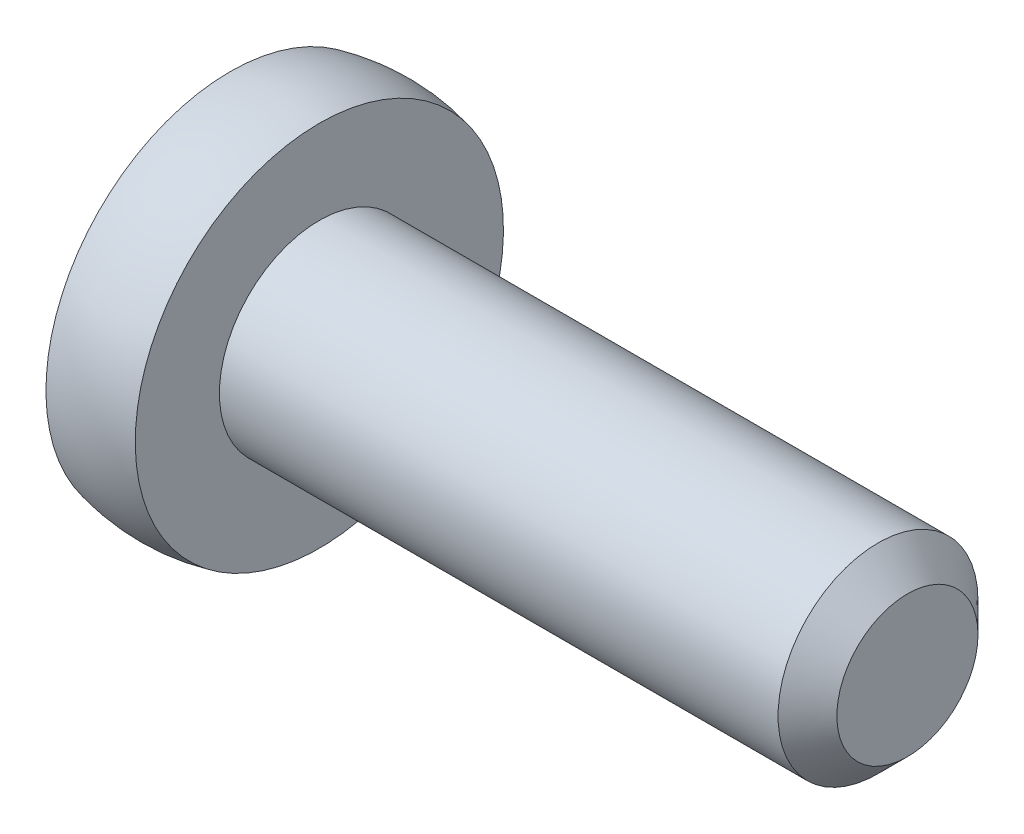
ISO-10303-21;
HEADER;
FILE_DESCRIPTION(('STEP AP214'),'2;1');
FILE_NAME('part.step','',(''),(''),'','','');
FILE_SCHEMA(('AUTOMOTIVE_DESIGN { 1 0 10303 214 1 1 1 1 }'));
ENDSEC;
DATA;
#1=APPLICATION_CONTEXT('core data for automotive mechanical design processes');
#2=APPLICATION_PROTOCOL_DEFINITION('international standard','automotive_design',2000,#1);
#3=PRODUCT_CONTEXT('',#1,'mechanical');
#4=PRODUCT('Part','Part','',(#3));
#5=PRODUCT_RELATED_PRODUCT_CATEGORY('part','',(#4));
#6=PRODUCT_DEFINITION_FORMATION('','',#4);
#7=PRODUCT_DEFINITION_CONTEXT('part definition',#1,'design');
#8=PRODUCT_DEFINITION('design','',#6,#7);
#9=PRODUCT_DEFINITION_SHAPE('','',#8);
#10=(LENGTH_UNIT() NAMED_UNIT(*) SI_UNIT(.MILLI.,.METRE.));
#11=(NAMED_UNIT(*) PLANE_ANGLE_UNIT() SI_UNIT($,.RADIAN.));
#12=(NAMED_UNIT(*) SI_UNIT($,.STERADIAN.) SOLID_ANGLE_UNIT());
#13=UNCERTAINTY_MEASURE_WITH_UNIT(LENGTH_MEASURE(1.E-05),#10,'distance_accuracy_value','');
#14=(GEOMETRIC_REPRESENTATION_CONTEXT(3) GLOBAL_UNCERTAINTY_ASSIGNED_CONTEXT((#13)) GLOBAL_UNIT_ASSIGNED_CONTEXT((#10,
#11,#12)) REPRESENTATION_CONTEXT('',''));
#15=CARTESIAN_POINT('',(0.,0.,0.));
#16=DIRECTION('',(0.,0.,1.));
#17=DIRECTION('',(1.,0.,0.));
#18=AXIS2_PLACEMENT_3D('',#15,#16,#17);
#19=CARTESIAN_POINT('',(2.20574710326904,0.,0.));
#20=DIRECTION('',(1.,0.,0.));
#21=DIRECTION('',(0.,0.,-1.));
#22=AXIS2_PLACEMENT_3D('',#19,#20,#21);
#23=PLANE('',#22);
#24=CARTESIAN_POINT('',(2.20574710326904,0.,0.));
#25=DIRECTION('',(1.,0.,0.));
#26=DIRECTION('',(0.,0.,-1.));
#27=AXIS2_PLACEMENT_3D('',#24,#25,#26);
#28=CIRCLE('',#27,3.97587531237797);
#29=CARTESIAN_POINT('',(2.20574710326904,3.97587531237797,0.));
#30=VERTEX_POINT('',#29);
#31=EDGE_CURVE('E147',#30,#30,#28,.T.);
#32=ORIENTED_EDGE('',*,*,#31,.T.);
#33=EDGE_LOOP('',(#32));
#34=FACE_BOUND('',#33,.T.);
#35=CARTESIAN_POINT('',(2.20574710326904,0.,0.));
#36=DIRECTION('',(1.,0.,0.));
#37=DIRECTION('',(0.,0.,-1.));
#38=AXIS2_PLACEMENT_3D('',#35,#36,#37);
#39=CIRCLE('',#38,2.159);
#40=CARTESIAN_POINT('',(2.20574710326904,0.,-2.159));
#41=VERTEX_POINT('',#40);
#42=EDGE_CURVE('E140',#41,#41,#39,.T.);
#43=ORIENTED_EDGE('',*,*,#42,.F.);
#44=EDGE_LOOP('',(#43));
#45=FACE_BOUND('',#44,.T.);
#46=ADVANCED_FACE('F36',(#34,#45),#23,.T.);
#47=CARTESIAN_POINT('',(6.77774710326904,0.,0.));
#48=DIRECTION('',(1.,0.,0.));
#49=DIRECTION('',(0.,1.,0.));
#50=AXIS2_PLACEMENT_3D('',#47,#48,#49);
#51=SPHERICAL_SURFACE('',#50,7.62);
#52=CARTESIAN_POINT('',(0.277222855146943,0.,0.));
#53=DIRECTION('',(1.,0.,0.));
#54=DIRECTION('',(0.,0.,-1.));
#55=AXIS2_PLACEMENT_3D('',#52,#53,#54);
#56=CIRCLE('',#55,3.97587531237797);
#57=CARTESIAN_POINT('',(0.277222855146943,3.97587531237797,0.));
#58=VERTEX_POINT('',#57);
#59=EDGE_CURVE('E143',#58,#58,#56,.T.);
#60=ORIENTED_EDGE('',*,*,#59,.F.);
#61=EDGE_LOOP('',(#60));
#62=FACE_BOUND('',#61,.T.);
#63=CARTESIAN_POINT('',(6.58914186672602,-0.97028982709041,0.));
#64=DIRECTION('',(0.190808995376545,0.981627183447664,0.));
#65=DIRECTION('',(-0.981627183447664,0.190808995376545,0.));
#66=AXIS2_PLACEMENT_3D('',#63,#64,#65);
#67=CIRCLE('',#66,7.55561815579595);
#68=CARTESIAN_POINT('',(-0.813379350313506,0.468614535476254,0.468614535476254));
#69=VERTEX_POINT('',#68);
#70=CARTESIAN_POINT('',(-0.434610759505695,0.394989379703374,2.42698937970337));
#71=VERTEX_POINT('',#70);
#72=EDGE_CURVE('E201',#69,#71,#67,.T.);
#73=ORIENTED_EDGE('',*,*,#72,.T.);
#74=CARTESIAN_POINT('',(6.96974216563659,0.,0.987728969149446));
#75=DIRECTION('',(0.190808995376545,0.,0.981627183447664));
#76=DIRECTION('',(0.981627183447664,0.,-0.190808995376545));
#77=AXIS2_PLACEMENT_3D('',#74,#75,#76);
#78=CIRCLE('',#77,7.55327275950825);
#79=CARTESIAN_POINT('',(-0.434610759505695,-0.394989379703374,2.42698937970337));
#80=VERTEX_POINT('',#79);
#81=EDGE_CURVE('E232',#71,#80,#78,.T.);
#82=ORIENTED_EDGE('',*,*,#81,.T.);
#83=CARTESIAN_POINT('',(6.58914186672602,0.97028982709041,0.));
#84=DIRECTION('',(0.190808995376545,-0.981627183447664,0.));
#85=DIRECTION('',(0.981627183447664,0.190808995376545,0.));
#86=AXIS2_PLACEMENT_3D('',#83,#84,#85);
#87=CIRCLE('',#86,7.55561815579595);
#88=CARTESIAN_POINT('',(-0.813379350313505,-0.468614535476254,0.468614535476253));
#89=VERTEX_POINT('',#88);
#90=EDGE_CURVE('E59',#80,#89,#87,.T.);
#91=ORIENTED_EDGE('',*,*,#90,.T.);
#92=CARTESIAN_POINT('',(6.58914186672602,0.,-0.970289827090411));
#93=DIRECTION('',(0.190808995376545,0.,0.981627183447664));
#94=DIRECTION('',(0.981627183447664,0.,-0.190808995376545));
#95=AXIS2_PLACEMENT_3D('',#92,#93,#94);
#96=CIRCLE('',#95,7.55561815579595);
#97=CARTESIAN_POINT('',(-0.434610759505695,-2.42698937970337,0.394989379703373));
#98=VERTEX_POINT('',#97);
#99=EDGE_CURVE('E228',#89,#98,#96,.T.);
#100=ORIENTED_EDGE('',*,*,#99,.T.);
#101=CARTESIAN_POINT('',(6.96974216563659,-0.987728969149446,0.));
#102=DIRECTION('',(0.190808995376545,-0.981627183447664,0.));
#103=DIRECTION('',(0.981627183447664,0.190808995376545,0.));
#104=AXIS2_PLACEMENT_3D('',#101,#102,#103);
#105=CIRCLE('',#104,7.55327275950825);
#106=CARTESIAN_POINT('',(-0.434610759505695,-2.42698937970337,-0.394989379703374));
#107=VERTEX_POINT('',#106);
#108=EDGE_CURVE('E225',#98,#107,#105,.T.);
#109=ORIENTED_EDGE('',*,*,#108,.T.);
#110=CARTESIAN_POINT('',(6.58914186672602,0.,0.97028982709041));
#111=DIRECTION('',(0.190808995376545,0.,-0.981627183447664));
#112=DIRECTION('',(-0.981627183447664,0.,-0.190808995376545));
#113=AXIS2_PLACEMENT_3D('',#110,#111,#112);
#114=CIRCLE('',#113,7.55561815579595);
#115=CARTESIAN_POINT('',(-0.813379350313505,-0.468614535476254,-0.468614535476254));
#116=VERTEX_POINT('',#115);
#117=EDGE_CURVE('E222',#107,#116,#114,.T.);
#118=ORIENTED_EDGE('',*,*,#117,.T.);
#119=CARTESIAN_POINT('',(6.58914186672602,0.97028982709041,0.));
#120=DIRECTION('',(0.190808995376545,-0.981627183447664,0.));
#121=DIRECTION('',(0.981627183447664,0.190808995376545,0.));
#122=AXIS2_PLACEMENT_3D('',#119,#120,#121);
#123=CIRCLE('',#122,7.55561815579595);
#124=CARTESIAN_POINT('',(-0.434610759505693,-0.394989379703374,-2.42698937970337));
#125=VERTEX_POINT('',#124);
#126=EDGE_CURVE('E219',#116,#125,#123,.T.);
#127=ORIENTED_EDGE('',*,*,#126,.T.);
#128=CARTESIAN_POINT('',(6.96974216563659,0.,-0.987728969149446));
#129=DIRECTION('',(0.190808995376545,0.,-0.981627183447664));
#130=DIRECTION('',(-0.981627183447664,0.,-0.190808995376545));
#131=AXIS2_PLACEMENT_3D('',#128,#129,#130);
#132=CIRCLE('',#131,7.55327275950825);
#133=CARTESIAN_POINT('',(-0.434610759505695,0.394989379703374,-2.42698937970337));
#134=VERTEX_POINT('',#133);
#135=EDGE_CURVE('E216',#125,#134,#132,.T.);
#136=ORIENTED_EDGE('',*,*,#135,.T.);
#137=CARTESIAN_POINT('',(6.58914186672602,-0.97028982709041,0.));
#138=DIRECTION('',(0.190808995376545,0.981627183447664,0.));
#139=DIRECTION('',(-0.981627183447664,0.190808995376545,0.));
#140=AXIS2_PLACEMENT_3D('',#137,#138,#139);
#141=CIRCLE('',#140,7.55561815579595);
#142=CARTESIAN_POINT('',(-0.813379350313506,0.468614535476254,-0.468614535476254));
#143=VERTEX_POINT('',#142);
#144=EDGE_CURVE('E213',#134,#143,#141,.T.);
#145=ORIENTED_EDGE('',*,*,#144,.T.);
#146=CARTESIAN_POINT('',(6.58914186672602,0.,0.97028982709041));
#147=DIRECTION('',(0.190808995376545,0.,-0.981627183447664));
#148=DIRECTION('',(-0.981627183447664,0.,-0.190808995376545));
#149=AXIS2_PLACEMENT_3D('',#146,#147,#148);
#150=CIRCLE('',#149,7.55561815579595);
#151=CARTESIAN_POINT('',(-0.434610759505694,2.42698937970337,-0.394989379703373));
#152=VERTEX_POINT('',#151);
#153=EDGE_CURVE('E210',#143,#152,#150,.T.);
#154=ORIENTED_EDGE('',*,*,#153,.T.);
#155=CARTESIAN_POINT('',(6.96974216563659,0.987728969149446,0.));
#156=DIRECTION('',(0.190808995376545,0.981627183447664,0.));
#157=DIRECTION('',(-0.981627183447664,0.190808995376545,0.));
#158=AXIS2_PLACEMENT_3D('',#155,#156,#157);
#159=CIRCLE('',#158,7.55327275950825);
#160=CARTESIAN_POINT('',(-0.434610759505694,2.42698937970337,0.394989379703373));
#161=VERTEX_POINT('',#160);
#162=EDGE_CURVE('E207',#152,#161,#159,.T.);
#163=ORIENTED_EDGE('',*,*,#162,.T.);
#164=CARTESIAN_POINT('',(6.58914186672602,0.,-0.97028982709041));
#165=DIRECTION('',(0.190808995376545,0.,0.981627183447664));
#166=DIRECTION('',(0.981627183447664,0.,-0.190808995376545));
#167=AXIS2_PLACEMENT_3D('',#164,#165,#166);
#168=CIRCLE('',#167,7.55561815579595);
#169=EDGE_CURVE('E204',#161,#69,#168,.T.);
#170=ORIENTED_EDGE('',*,*,#169,.T.);
#171=EDGE_LOOP('',(#73,#82,#91,#100,#109,#118,#127,#136,#145,#154,#163,#170));
#172=FACE_BOUND('',#171,.T.);
#173=ADVANCED_FACE('F247',(#62,#172),#51,.T.);
#174=CARTESIAN_POINT('',(1.24148497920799,0.,0.));
#175=DIRECTION('',(1.,0.,0.));
#176=DIRECTION('',(0.,1.,0.));
#177=AXIS2_PLACEMENT_3D('',#174,#175,#176);
#178=SPHERICAL_SURFACE('',#177,4.09113504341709);
#179=CARTESIAN_POINT('',(0.277222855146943,3.97587531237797,0.));
#180=CARTESIAN_POINT('',(0.296931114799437,3.98065513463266,0.));
#181=CARTESIAN_POINT('',(0.31667491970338,3.98528839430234,0.));
#182=CARTESIAN_POINT('',(0.356229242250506,3.9942608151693,0.));
#183=CARTESIAN_POINT('',(0.376039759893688,3.99859997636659,0.));
#184=CARTESIAN_POINT('',(0.415723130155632,4.00698322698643,0.));
#185=CARTESIAN_POINT('',(0.435595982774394,4.01102731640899,0.));
#186=CARTESIAN_POINT('',(0.475399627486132,4.01881953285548,0.));
#187=CARTESIAN_POINT('',(0.495330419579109,4.02256765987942,0.));
#188=CARTESIAN_POINT('',(0.535245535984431,4.02976712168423,0.));
#189=CARTESIAN_POINT('',(0.555229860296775,4.0332184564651,0.));
#190=CARTESIAN_POINT('',(0.5952476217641,4.0398235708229,0.));
#191=CARTESIAN_POINT('',(0.615281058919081,4.04297735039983,0.));
#192=CARTESIAN_POINT('',(0.655392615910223,4.04898665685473,0.));
#193=CARTESIAN_POINT('',(0.675470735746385,4.05184218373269,0.));
#194=CARTESIAN_POINT('',(0.715667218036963,4.05725435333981,0.));
#195=CARTESIAN_POINT('',(0.735785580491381,4.05981099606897,0.));
#196=CARTESIAN_POINT('',(0.77605809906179,4.06462483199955,0.));
#197=CARTESIAN_POINT('',(0.796212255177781,4.06688202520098,0.));
#198=CARTESIAN_POINT('',(0.836551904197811,4.07109646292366,0.));
#199=CARTESIAN_POINT('',(0.856737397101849,4.07305370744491,0.));
#200=CARTESIAN_POINT('',(0.897135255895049,4.07666781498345,0.));
#201=CARTESIAN_POINT('',(0.917347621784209,4.07832467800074,0.));
#202=CARTESIAN_POINT('',(0.957794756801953,4.08133765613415,0.));
#203=CARTESIAN_POINT('',(0.978029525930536,4.08269377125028,0.));
#204=CARTESIAN_POINT('',(1.01851699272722,4.08510495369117,0.));
#205=CARTESIAN_POINT('',(1.03876969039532,4.08616002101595,0.));
#206=CARTESIAN_POINT('',(1.07928853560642,4.08796887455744,0.));
#207=CARTESIAN_POINT('',(1.09955468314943,4.08872266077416,0.));
#208=CARTESIAN_POINT('',(1.14009594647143,4.08992878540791,0.));
#209=CARTESIAN_POINT('',(1.16037106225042,4.09038112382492,0.));
#210=CARTESIAN_POINT('',(1.20092577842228,4.09098425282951,0.));
#211=CARTESIAN_POINT('',(1.22120537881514,4.09113504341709,0.));
#212=CARTESIAN_POINT('',(1.26176457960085,4.09113504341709,0.));
#213=CARTESIAN_POINT('',(1.28204417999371,4.09098425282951,0.));
#214=CARTESIAN_POINT('',(1.32259889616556,4.09038112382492,0.));
#215=CARTESIAN_POINT('',(1.34287401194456,4.08992878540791,0.));
#216=CARTESIAN_POINT('',(1.38341527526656,4.08872266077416,0.));
#217=CARTESIAN_POINT('',(1.40368142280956,4.08796887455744,0.));
#218=CARTESIAN_POINT('',(1.44420026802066,4.08616002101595,0.));
#219=CARTESIAN_POINT('',(1.46445296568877,4.08510495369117,0.));
#220=CARTESIAN_POINT('',(1.50494043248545,4.08269377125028,0.));
#221=CARTESIAN_POINT('',(1.52517520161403,4.08133765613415,0.));
#222=CARTESIAN_POINT('',(1.56562233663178,4.07832467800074,0.));
#223=CARTESIAN_POINT('',(1.58583470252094,4.07666781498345,0.));
#224=CARTESIAN_POINT('',(1.62623256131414,4.07305370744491,0.));
#225=CARTESIAN_POINT('',(1.64641805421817,4.07109646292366,0.));
#226=CARTESIAN_POINT('',(1.6867577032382,4.06688202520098,0.));
#227=CARTESIAN_POINT('',(1.70691185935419,4.06462483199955,0.));
#228=CARTESIAN_POINT('',(1.7471843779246,4.05981099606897,0.));
#229=CARTESIAN_POINT('',(1.76730274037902,4.05725435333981,0.));
#230=CARTESIAN_POINT('',(1.8074992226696,4.05184218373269,0.));
#231=CARTESIAN_POINT('',(1.82757734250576,4.04898665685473,0.));
#232=CARTESIAN_POINT('',(1.8676888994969,4.04297735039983,0.));
#233=CARTESIAN_POINT('',(1.88772233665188,4.0398235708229,0.));
#234=CARTESIAN_POINT('',(1.92774009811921,4.0332184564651,0.));
#235=CARTESIAN_POINT('',(1.94772442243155,4.02976712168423,0.));
#236=CARTESIAN_POINT('',(1.98763953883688,4.02256765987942,0.));
#237=CARTESIAN_POINT('',(2.00757033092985,4.01881953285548,0.));
#238=CARTESIAN_POINT('',(2.04737397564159,4.01102731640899,0.));
#239=CARTESIAN_POINT('',(2.06724682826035,4.00698322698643,0.));
#240=CARTESIAN_POINT('',(2.1069301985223,3.99859997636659,0.));
#241=CARTESIAN_POINT('',(2.12674071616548,3.9942608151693,0.));
#242=CARTESIAN_POINT('',(2.1662950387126,3.98528839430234,0.));
#243=CARTESIAN_POINT('',(2.18603884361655,3.98065513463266,0.));
#244=CARTESIAN_POINT('',(2.20574710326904,3.97587531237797,0.));
#245=B_SPLINE_CURVE_WITH_KNOTS('',3,(#179,#180,#181,#182,#183,#184,#185,#186,#187,#188,#189,
#190,#191,#192,#193,#194,#195,#196,#197,#198,#199,#200,#201,#202,#203,#204,#205,#206,#207,#208,
#209,#210,#211,#212,#213,#214,#215,#216,#217,#218,#219,#220,#221,#222,#223,#224,#225,#226,#227,
#228,#229,#230,#231,#232,#233,#234,#235,#236,#237,#238,#239,#240,#241,#242,#243,#244),
.UNSPECIFIED.,.F.,.F.,(4,2,2,2,2,2,2,2,2,2,2,2,2,2,2,2,2,2,2,2,2,2,2,2,2,2,2,2,2,2,2,2,4),(0.,
0.0608382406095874,0.121676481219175,0.182514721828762,0.243352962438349,0.304191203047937,
0.365029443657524,0.425867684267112,0.486705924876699,0.547544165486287,0.608382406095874,
0.669220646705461,0.730058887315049,0.790897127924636,0.851735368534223,0.912573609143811,
0.973411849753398,1.03425009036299,1.09508833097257,1.15592657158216,1.21676481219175,
1.27760305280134,1.33844129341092,1.39927953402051,1.4601177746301,1.52095601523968,
1.58179425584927,1.64263249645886,1.70347073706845,1.76430897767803,1.82514721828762,
1.88598545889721,1.9468236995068),.UNSPECIFIED.);
#246=EDGE_CURVE('BSEAM253',#58,#30,#245,.T.);
#247=ORIENTED_EDGE('',*,*,#59,.T.);
#248=ORIENTED_EDGE('',*,*,#31,.F.);
#249=ORIENTED_EDGE('',*,*,#246,.T.);
#250=ORIENTED_EDGE('',*,*,#246,.F.);
#251=EDGE_LOOP('',(#247,#249,#248,#250));
#252=FACE_BOUND('',#251,.T.);
#253=ADVANCED_FACE('F253',(#252),#178,.T.);
#254=CARTESIAN_POINT('',(-1.016,0.508,2.54));
#255=DIRECTION('',(0.190808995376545,0.,0.981627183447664));
#256=DIRECTION('',(0.981627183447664,0.,-0.190808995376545));
#257=AXIS2_PLACEMENT_3D('',#254,#255,#256);
#258=PLANE('',#257);
#259=DIRECTION('',(-0.964231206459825,0.187427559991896,0.187427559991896));
#260=VECTOR('',#259,1.);
#261=CARTESIAN_POINT('',(-1.016,0.508,2.54));
#262=LINE('',#261,#260);
#263=CARTESIAN_POINT('',(0.889,0.137705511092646,2.16970551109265));
#264=VERTEX_POINT('',#263);
#265=EDGE_CURVE('E51',#264,#71,#262,.T.);
#266=ORIENTED_EDGE('',*,*,#265,.F.);
#267=DIRECTION('',(0.,1.,0.));
#268=VECTOR('',#267,1.);
#269=CARTESIAN_POINT('',(0.889,-0.508,2.16970551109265));
#270=LINE('',#269,#268);
#271=CARTESIAN_POINT('',(0.889,-0.137705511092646,2.16970551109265));
#272=VERTEX_POINT('',#271);
#273=EDGE_CURVE('E131',#264,#272,#270,.F.);
#274=ORIENTED_EDGE('',*,*,#273,.T.);
#275=DIRECTION('',(-0.964231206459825,-0.187427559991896,0.187427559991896));
#276=VECTOR('',#275,1.);
#277=CARTESIAN_POINT('',(-0.648769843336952,-0.436617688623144,2.46861768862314));
#278=LINE('',#277,#276);
#279=EDGE_CURVE('E138',#272,#80,#278,.T.);
#280=ORIENTED_EDGE('',*,*,#279,.T.);
#281=ORIENTED_EDGE('',*,*,#81,.F.);
#282=EDGE_LOOP('',(#266,#274,#280,#281));
#283=FACE_BOUND('',#282,.T.);
#284=ADVANCED_FACE('F137',(#283),#258,.F.);
#285=CARTESIAN_POINT('',(-1.016,-0.508,0.507999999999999));
#286=DIRECTION('',(0.190808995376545,-0.981627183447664,0.));
#287=DIRECTION('',(0.981627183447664,0.190808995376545,0.));
#288=AXIS2_PLACEMENT_3D('',#285,#286,#287);
#289=PLANE('',#288);
#290=ORIENTED_EDGE('',*,*,#279,.F.);
#291=DIRECTION('',(0.,0.,1.));
#292=VECTOR('',#291,1.);
#293=CARTESIAN_POINT('',(0.889,-0.137705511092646,2.54));
#294=LINE('',#293,#292);
#295=CARTESIAN_POINT('',(0.889,-0.137705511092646,0.137705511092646));
#296=VERTEX_POINT('',#295);
#297=EDGE_CURVE('E127',#272,#296,#294,.F.);
#298=ORIENTED_EDGE('',*,*,#297,.T.);
#299=DIRECTION('',(-0.964231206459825,-0.187427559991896,0.187427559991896));
#300=VECTOR('',#299,1.);
#301=CARTESIAN_POINT('',(-1.016,-0.508,0.507999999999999));
#302=LINE('',#301,#300);
#303=EDGE_CURVE('E144',#296,#89,#302,.T.);
#304=ORIENTED_EDGE('',*,*,#303,.T.);
#305=ORIENTED_EDGE('',*,*,#90,.F.);
#306=EDGE_LOOP('',(#290,#298,#304,#305));
#307=FACE_BOUND('',#306,.T.);
#308=ADVANCED_FACE('F142',(#307),#289,.F.);
#309=CARTESIAN_POINT('',(-1.016,-2.54,0.507999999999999));
#310=DIRECTION('',(0.190808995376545,0.,0.981627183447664));
#311=DIRECTION('',(0.981627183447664,0.,-0.190808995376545));
#312=AXIS2_PLACEMENT_3D('',#309,#310,#311);
#313=PLANE('',#312);
#314=ORIENTED_EDGE('',*,*,#303,.F.);
#315=DIRECTION('',(0.,1.,0.));
#316=VECTOR('',#315,1.);
#317=CARTESIAN_POINT('',(0.889,-0.508,0.137705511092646));
#318=LINE('',#317,#316);
#319=CARTESIAN_POINT('',(0.889,-2.16970551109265,0.137705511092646));
#320=VERTEX_POINT('',#319);
#321=EDGE_CURVE('E133',#296,#320,#318,.F.);
#322=ORIENTED_EDGE('',*,*,#321,.T.);
#323=DIRECTION('',(-0.964231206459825,-0.187427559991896,0.187427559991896));
#324=VECTOR('',#323,1.);
#325=CARTESIAN_POINT('',(-1.016,-2.54,0.507999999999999));
#326=LINE('',#325,#324);
#327=EDGE_CURVE('E149',#320,#98,#326,.T.);
#328=ORIENTED_EDGE('',*,*,#327,.T.);
#329=ORIENTED_EDGE('',*,*,#99,.F.);
#330=EDGE_LOOP('',(#314,#322,#328,#329));
#331=FACE_BOUND('',#330,.T.);
#332=ADVANCED_FACE('F302',(#331),#313,.F.);
#333=CARTESIAN_POINT('',(-1.016,-2.54,0.507999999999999));
#334=DIRECTION('',(0.190808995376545,-0.981627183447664,0.));
#335=DIRECTION('',(0.981627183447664,0.190808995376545,0.));
#336=AXIS2_PLACEMENT_3D('',#333,#334,#335);
#337=PLANE('',#336);
#338=ORIENTED_EDGE('',*,*,#327,.F.);
#339=DIRECTION('',(0.,0.,1.));
#340=VECTOR('',#339,1.);
#341=CARTESIAN_POINT('',(0.889,-2.16970551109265,2.54));
#342=LINE('',#341,#340);
#343=CARTESIAN_POINT('',(0.889,-2.16970551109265,-0.137705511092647));
#344=VERTEX_POINT('',#343);
#345=EDGE_CURVE('E182',#320,#344,#342,.F.);
#346=ORIENTED_EDGE('',*,*,#345,.T.);
#347=DIRECTION('',(-0.964231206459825,-0.187427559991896,-0.187427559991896));
#348=VECTOR('',#347,1.);
#349=CARTESIAN_POINT('',(-0.648769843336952,-2.46861768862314,-0.436617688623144));
#350=LINE('',#349,#348);
#351=EDGE_CURVE('E176',#344,#107,#350,.T.);
#352=ORIENTED_EDGE('',*,*,#351,.T.);
#353=ORIENTED_EDGE('',*,*,#108,.F.);
#354=EDGE_LOOP('',(#338,#346,#352,#353));
#355=FACE_BOUND('',#354,.T.);
#356=ADVANCED_FACE('F300',(#355),#337,.F.);
#357=CARTESIAN_POINT('',(-1.016,-0.508,-0.508));
#358=DIRECTION('',(0.190808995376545,0.,-0.981627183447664));
#359=DIRECTION('',(-0.981627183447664,0.,-0.190808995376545));
#360=AXIS2_PLACEMENT_3D('',#357,#358,#359);
#361=PLANE('',#360);
#362=ORIENTED_EDGE('',*,*,#351,.F.);
#363=DIRECTION('',(0.,-1.,0.));
#364=VECTOR('',#363,1.);
#365=CARTESIAN_POINT('',(0.889,-0.508,-0.137705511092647));
#366=LINE('',#365,#364);
#367=CARTESIAN_POINT('',(0.889,-0.137705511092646,-0.137705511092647));
#368=VERTEX_POINT('',#367);
#369=EDGE_CURVE('E184',#344,#368,#366,.F.);
#370=ORIENTED_EDGE('',*,*,#369,.T.);
#371=DIRECTION('',(-0.964231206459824,-0.187427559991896,-0.187427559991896));
#372=VECTOR('',#371,1.);
#373=CARTESIAN_POINT('',(-1.016,-0.508,-0.508));
#374=LINE('',#373,#372);
#375=EDGE_CURVE('E173',#368,#116,#374,.T.);
#376=ORIENTED_EDGE('',*,*,#375,.T.);
#377=ORIENTED_EDGE('',*,*,#117,.F.);
#378=EDGE_LOOP('',(#362,#370,#376,#377));
#379=FACE_BOUND('',#378,.T.);
#380=ADVANCED_FACE('F297',(#379),#361,.F.);
#381=CARTESIAN_POINT('',(-1.016,-0.508,-2.54));
#382=DIRECTION('',(0.190808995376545,-0.981627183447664,0.));
#383=DIRECTION('',(0.981627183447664,0.190808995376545,0.));
#384=AXIS2_PLACEMENT_3D('',#381,#382,#383);
#385=PLANE('',#384);
#386=ORIENTED_EDGE('',*,*,#375,.F.);
#387=DIRECTION('',(0.,0.,1.));
#388=VECTOR('',#387,1.);
#389=CARTESIAN_POINT('',(0.889,-0.137705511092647,2.54));
#390=LINE('',#389,#388);
#391=CARTESIAN_POINT('',(0.889,-0.137705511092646,-2.16970551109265));
#392=VERTEX_POINT('',#391);
#393=EDGE_CURVE('E186',#368,#392,#390,.F.);
#394=ORIENTED_EDGE('',*,*,#393,.T.);
#395=DIRECTION('',(-0.964231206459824,-0.187427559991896,-0.187427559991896));
#396=VECTOR('',#395,1.);
#397=CARTESIAN_POINT('',(-0.832384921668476,-0.472308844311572,-2.50430884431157));
#398=LINE('',#397,#396);
#399=EDGE_CURVE('E170',#392,#125,#398,.T.);
#400=ORIENTED_EDGE('',*,*,#399,.T.);
#401=ORIENTED_EDGE('',*,*,#126,.F.);
#402=EDGE_LOOP('',(#386,#394,#400,#401));
#403=FACE_BOUND('',#402,.T.);
#404=ADVANCED_FACE('F294',(#403),#385,.F.);
#405=CARTESIAN_POINT('',(-1.016,0.508,-2.54));
#406=DIRECTION('',(0.190808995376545,0.,-0.981627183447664));
#407=DIRECTION('',(-0.981627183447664,0.,-0.190808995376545));
#408=AXIS2_PLACEMENT_3D('',#405,#406,#407);
#409=PLANE('',#408);
#410=ORIENTED_EDGE('',*,*,#399,.F.);
#411=DIRECTION('',(0.,-1.,0.));
#412=VECTOR('',#411,1.);
#413=CARTESIAN_POINT('',(0.889,-0.508,-2.16970551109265));
#414=LINE('',#413,#412);
#415=CARTESIAN_POINT('',(0.889,0.137705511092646,-2.16970551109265));
#416=VERTEX_POINT('',#415);
#417=EDGE_CURVE('E188',#392,#416,#414,.F.);
#418=ORIENTED_EDGE('',*,*,#417,.T.);
#419=DIRECTION('',(-0.964231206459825,0.187427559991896,-0.187427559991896));
#420=VECTOR('',#419,1.);
#421=CARTESIAN_POINT('',(-0.648769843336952,0.436617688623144,-2.46861768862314));
#422=LINE('',#421,#420);
#423=EDGE_CURVE('E167',#416,#134,#422,.T.);
#424=ORIENTED_EDGE('',*,*,#423,.T.);
#425=ORIENTED_EDGE('',*,*,#135,.F.);
#426=EDGE_LOOP('',(#410,#418,#424,#425));
#427=FACE_BOUND('',#426,.T.);
#428=ADVANCED_FACE('F288',(#427),#409,.F.);
#429=CARTESIAN_POINT('',(-1.016,0.508,-0.508));
#430=DIRECTION('',(0.190808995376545,0.981627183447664,0.));
#431=DIRECTION('',(-0.981627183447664,0.190808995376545,0.));
#432=AXIS2_PLACEMENT_3D('',#429,#430,#431);
#433=PLANE('',#432);
#434=ORIENTED_EDGE('',*,*,#423,.F.);
#435=DIRECTION('',(0.,0.,-1.));
#436=VECTOR('',#435,1.);
#437=CARTESIAN_POINT('',(0.889,0.137705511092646,2.54));
#438=LINE('',#437,#436);
#439=CARTESIAN_POINT('',(0.889,0.137705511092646,-0.137705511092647));
#440=VERTEX_POINT('',#439);
#441=EDGE_CURVE('E190',#416,#440,#438,.F.);
#442=ORIENTED_EDGE('',*,*,#441,.T.);
#443=DIRECTION('',(-0.964231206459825,0.187427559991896,-0.187427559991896));
#444=VECTOR('',#443,1.);
#445=CARTESIAN_POINT('',(-1.016,0.508,-0.508));
#446=LINE('',#445,#444);
#447=EDGE_CURVE('E164',#440,#143,#446,.T.);
#448=ORIENTED_EDGE('',*,*,#447,.T.);
#449=ORIENTED_EDGE('',*,*,#144,.F.);
#450=EDGE_LOOP('',(#434,#442,#448,#449));
#451=FACE_BOUND('',#450,.T.);
#452=ADVANCED_FACE('F285',(#451),#433,.F.);
#453=CARTESIAN_POINT('',(-1.016,2.54,-0.508));
#454=DIRECTION('',(0.190808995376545,0.,-0.981627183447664));
#455=DIRECTION('',(-0.981627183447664,0.,-0.190808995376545));
#456=AXIS2_PLACEMENT_3D('',#453,#454,#455);
#457=PLANE('',#456);
#458=ORIENTED_EDGE('',*,*,#447,.F.);
#459=DIRECTION('',(0.,-1.,0.));
#460=VECTOR('',#459,1.);
#461=CARTESIAN_POINT('',(0.889,-0.507999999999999,-0.137705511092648));
#462=LINE('',#461,#460);
#463=CARTESIAN_POINT('',(0.889,2.16970551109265,-0.137705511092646));
#464=VERTEX_POINT('',#463);
#465=EDGE_CURVE('E192',#440,#464,#462,.F.);
#466=ORIENTED_EDGE('',*,*,#465,.T.);
#467=DIRECTION('',(-0.964231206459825,0.187427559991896,-0.187427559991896));
#468=VECTOR('',#467,1.);
#469=CARTESIAN_POINT('',(-0.832384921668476,2.50430884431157,-0.472308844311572));
#470=LINE('',#469,#468);
#471=EDGE_CURVE('E161',#464,#152,#470,.T.);
#472=ORIENTED_EDGE('',*,*,#471,.T.);
#473=ORIENTED_EDGE('',*,*,#153,.F.);
#474=EDGE_LOOP('',(#458,#466,#472,#473));
#475=FACE_BOUND('',#474,.T.);
#476=ADVANCED_FACE('F282',(#475),#457,.F.);
#477=CARTESIAN_POINT('',(-1.016,2.54,0.508));
#478=DIRECTION('',(0.190808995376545,0.981627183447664,0.));
#479=DIRECTION('',(-0.981627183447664,0.190808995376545,0.));
#480=AXIS2_PLACEMENT_3D('',#477,#478,#479);
#481=PLANE('',#480);
#482=ORIENTED_EDGE('',*,*,#471,.F.);
#483=DIRECTION('',(0.,0.,-1.));
#484=VECTOR('',#483,1.);
#485=CARTESIAN_POINT('',(0.889,2.16970551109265,2.54));
#486=LINE('',#485,#484);
#487=CARTESIAN_POINT('',(0.889,2.16970551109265,0.137705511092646));
#488=VERTEX_POINT('',#487);
#489=EDGE_CURVE('E194',#464,#488,#486,.F.);
#490=ORIENTED_EDGE('',*,*,#489,.T.);
#491=DIRECTION('',(-0.964231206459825,0.187427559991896,0.187427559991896));
#492=VECTOR('',#491,1.);
#493=CARTESIAN_POINT('',(-0.648769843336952,2.46861768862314,0.436617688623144));
#494=LINE('',#493,#492);
#495=EDGE_CURVE('E158',#488,#161,#494,.T.);
#496=ORIENTED_EDGE('',*,*,#495,.T.);
#497=ORIENTED_EDGE('',*,*,#162,.F.);
#498=EDGE_LOOP('',(#482,#490,#496,#497));
#499=FACE_BOUND('',#498,.T.);
#500=ADVANCED_FACE('F279',(#499),#481,.F.);
#501=CARTESIAN_POINT('',(-1.016,0.508,0.508));
#502=DIRECTION('',(0.190808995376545,0.,0.981627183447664));
#503=DIRECTION('',(0.981627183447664,0.,-0.190808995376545));
#504=AXIS2_PLACEMENT_3D('',#501,#502,#503);
#505=PLANE('',#504);
#506=ORIENTED_EDGE('',*,*,#495,.F.);
#507=DIRECTION('',(0.,1.,0.));
#508=VECTOR('',#507,1.);
#509=CARTESIAN_POINT('',(0.889,-0.508,0.137705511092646));
#510=LINE('',#509,#508);
#511=CARTESIAN_POINT('',(0.889,0.137705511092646,0.137705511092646));
#512=VERTEX_POINT('',#511);
#513=EDGE_CURVE('E196',#488,#512,#510,.F.);
#514=ORIENTED_EDGE('',*,*,#513,.T.);
#515=DIRECTION('',(-0.964231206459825,0.187427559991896,0.187427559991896));
#516=VECTOR('',#515,1.);
#517=CARTESIAN_POINT('',(-1.016,0.508,0.508));
#518=LINE('',#517,#516);
#519=EDGE_CURVE('E154',#512,#69,#518,.T.);
#520=ORIENTED_EDGE('',*,*,#519,.T.);
#521=ORIENTED_EDGE('',*,*,#169,.F.);
#522=EDGE_LOOP('',(#506,#514,#520,#521));
#523=FACE_BOUND('',#522,.T.);
#524=ADVANCED_FACE('F272',(#523),#505,.F.);
#525=CARTESIAN_POINT('',(-1.016,0.508,2.54));
#526=DIRECTION('',(0.190808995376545,0.981627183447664,0.));
#527=DIRECTION('',(-0.981627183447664,0.190808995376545,0.));
#528=AXIS2_PLACEMENT_3D('',#525,#526,#527);
#529=PLANE('',#528);
#530=ORIENTED_EDGE('',*,*,#519,.F.);
#531=DIRECTION('',(0.,0.,-1.));
#532=VECTOR('',#531,1.);
#533=CARTESIAN_POINT('',(0.889,0.137705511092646,2.54));
#534=LINE('',#533,#532);
#535=EDGE_CURVE('E155',#512,#264,#534,.F.);
#536=ORIENTED_EDGE('',*,*,#535,.T.);
#537=ORIENTED_EDGE('',*,*,#265,.T.);
#538=ORIENTED_EDGE('',*,*,#72,.F.);
#539=EDGE_LOOP('',(#530,#536,#537,#538));
#540=FACE_BOUND('',#539,.T.);
#541=ADVANCED_FACE('F269',(#540),#529,.F.);
#542=CARTESIAN_POINT('',(0.889,-0.508,2.54));
#543=DIRECTION('',(-1.,0.,0.));
#544=DIRECTION('',(0.,0.,1.));
#545=AXIS2_PLACEMENT_3D('',#542,#543,#544);
#546=PLANE('',#545);
#547=ORIENTED_EDGE('',*,*,#273,.F.);
#548=ORIENTED_EDGE('',*,*,#535,.F.);
#549=ORIENTED_EDGE('',*,*,#513,.F.);
#550=ORIENTED_EDGE('',*,*,#489,.F.);
#551=ORIENTED_EDGE('',*,*,#465,.F.);
#552=ORIENTED_EDGE('',*,*,#441,.F.);
#553=ORIENTED_EDGE('',*,*,#417,.F.);
#554=ORIENTED_EDGE('',*,*,#393,.F.);
#555=ORIENTED_EDGE('',*,*,#369,.F.);
#556=ORIENTED_EDGE('',*,*,#345,.F.);
#557=ORIENTED_EDGE('',*,*,#321,.F.);
#558=ORIENTED_EDGE('',*,*,#297,.F.);
#559=EDGE_LOOP('',(#547,#548,#549,#550,#551,#552,#553,#554,#555,#556,#557,#558));
#560=FACE_BOUND('',#559,.T.);
#561=ADVANCED_FACE('F129',(#560),#546,.T.);
#562=CARTESIAN_POINT('',(14.905747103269,0.,0.));
#563=DIRECTION('',(-1.,0.,0.));
#564=DIRECTION('',(0.,0.,1.));
#565=AXIS2_PLACEMENT_3D('',#562,#563,#564);
#566=CYLINDRICAL_SURFACE('',#565,2.159);
#567=CARTESIAN_POINT('',(14.270747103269,0.,0.));
#568=DIRECTION('',(1.,0.,0.));
#569=DIRECTION('',(0.,0.,-1.));
#570=AXIS2_PLACEMENT_3D('',#567,#568,#569);
#571=CIRCLE('',#570,2.159);
#572=CARTESIAN_POINT('',(14.270747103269,0.,-2.159));
#573=VERTEX_POINT('',#572);
#574=EDGE_CURVE('E11',#573,#573,#571,.F.);
#575=ORIENTED_EDGE('',*,*,#574,.T.);
#576=EDGE_LOOP('',(#575));
#577=FACE_BOUND('',#576,.T.);
#578=ORIENTED_EDGE('',*,*,#42,.T.);
#579=EDGE_LOOP('',(#578));
#580=FACE_BOUND('',#579,.T.);
#581=ADVANCED_FACE('F243',(#577,#580),#566,.T.);
#582=CARTESIAN_POINT('',(14.905747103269,0.,0.));
#583=DIRECTION('',(1.,0.,0.));
#584=DIRECTION('',(0.,0.,-1.));
#585=AXIS2_PLACEMENT_3D('',#582,#583,#584);
#586=PLANE('',#585);
#587=CARTESIAN_POINT('',(14.905747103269,0.,0.));
#588=DIRECTION('',(1.,0.,0.));
#589=DIRECTION('',(0.,0.,-1.));
#590=AXIS2_PLACEMENT_3D('',#587,#588,#589);
#591=CIRCLE('',#590,1.524);
#592=CARTESIAN_POINT('',(14.905747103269,0.,-1.524));
#593=VERTEX_POINT('',#592);
#594=EDGE_CURVE('E44',#593,#593,#591,.T.);
#595=ORIENTED_EDGE('',*,*,#594,.T.);
#596=EDGE_LOOP('',(#595));
#597=FACE_BOUND('',#596,.T.);
#598=ADVANCED_FACE('F236',(#597),#586,.T.);
#599=CARTESIAN_POINT('',(14.905747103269,0.,0.));
#600=DIRECTION('',(-1.,0.,0.));
#601=DIRECTION('',(0.,0.,1.));
#602=AXIS2_PLACEMENT_3D('',#599,#600,#601);
#603=CONICAL_SURFACE('',#602,1.524,0.785398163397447);
#604=ORIENTED_EDGE('',*,*,#574,.F.);
#605=EDGE_LOOP('',(#604));
#606=FACE_BOUND('',#605,.T.);
#607=ORIENTED_EDGE('',*,*,#594,.F.);
#608=EDGE_LOOP('',(#607));
#609=FACE_BOUND('',#608,.T.);
#610=ADVANCED_FACE('F38',(#606,#609),#603,.T.);
#611=CLOSED_SHELL('',(#46,#173,#253,#284,#308,#332,#356,#380,#404,#428,#452,#476,#500,#524,#541,
#561,#581,#598,#610));
#612=MANIFOLD_SOLID_BREP('B2',#611);
#613=ADVANCED_BREP_SHAPE_REPRESENTATION('',(#18,#612),#14);
#614=SHAPE_DEFINITION_REPRESENTATION(#9,#613);
ENDSEC;
END-ISO-10303-21;
